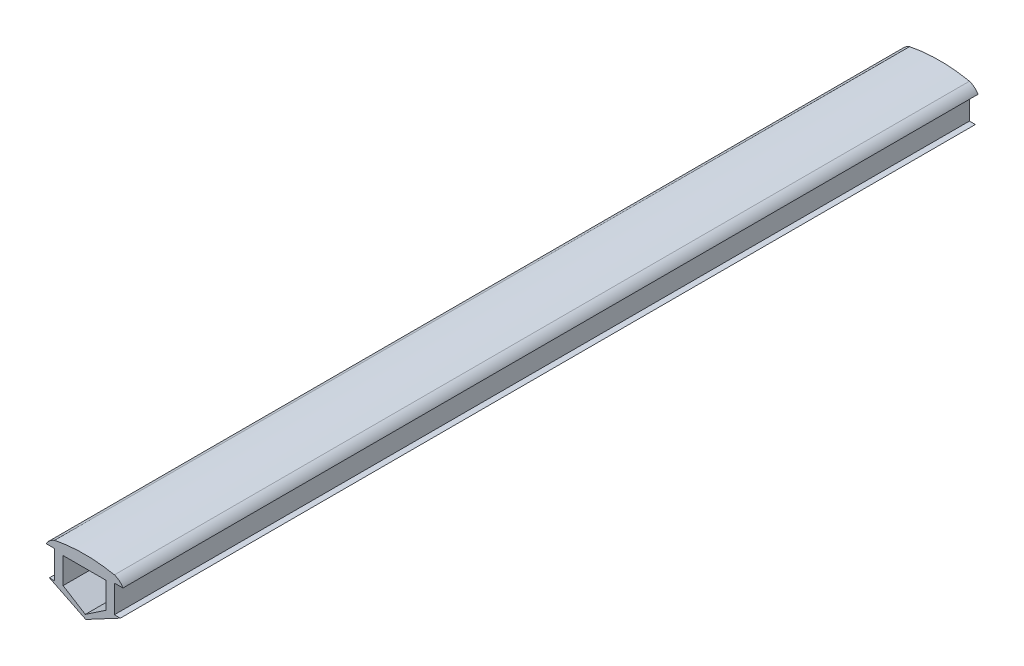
from build123d import *

# Parameters (mm, degrees)
EXTRUDE_1_DEPTH = 150


with BuildPart() as part:
    # Sketch 1 → Extrude 1 (new body)
    with BuildSketch(Plane.XY):
        with BuildLine():
            Line((-74.552617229, -2.785407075), (-74.552617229, -6.785407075))
            Line((-74.552617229, -6.785407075), (-75.457517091, -6.785407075))
            Line((-75.457517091, -6.785407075), (-69.071741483, -9.918858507))
            Line((-69.071741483, -9.918858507), (-63.013399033, -6.695042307))
            Line((-63.013399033, -6.695042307), (-64.052617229, -6.695042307))
            Line((-64.052617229, -6.695042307), (-64.052617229, -2.695042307))
            Line((-64.052617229, -2.695042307), (-64.052617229, -1.881399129))
            Line((-64.052617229, -1.881399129), (-62.552617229, -1.881399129))
            ThreePointArc((-62.552617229, -1.881399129), (-63.183760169, -1.114521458), (-64.052617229, -0.633345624))
            ThreePointArc((-64.052617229, -0.633345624), (-69.302617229, -0.106687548), (-74.552617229, -0.633345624))
            ThreePointArc((-74.552617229, -0.633345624), (-75.403371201, -1.136279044), (-76.052617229, -1.881399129))
            Line((-76.052617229, -1.881399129), (-74.552617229, -1.881399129))
            Line((-74.552617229, -1.881399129), (-74.552617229, -2.785407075))
        make_face()
        Polygon((-73.052617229, -2.195042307), (-65.552617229, -2.195042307), (-65.552617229, -6.772076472), (-69.153473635, -9.195042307), (-73.052617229, -6.772076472), align=None, mode=Mode.SUBTRACT)
    extrude(amount=EXTRUDE_1_DEPTH)


solid = part.part
